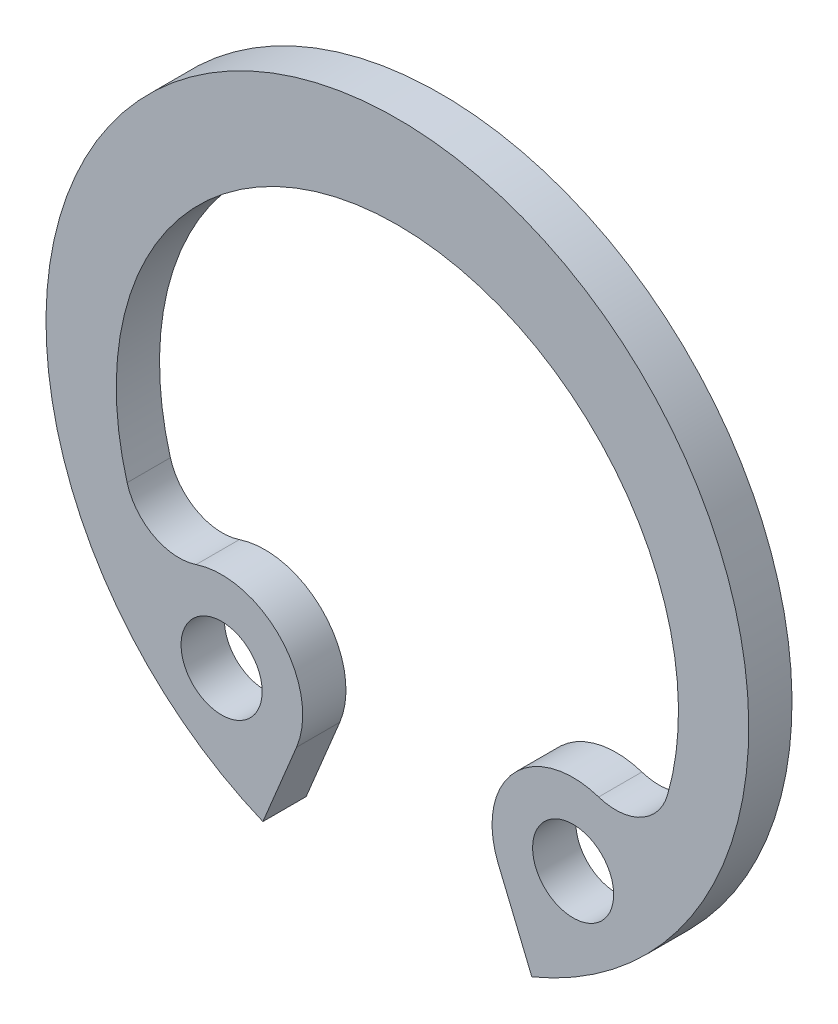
ISO-10303-21;
HEADER;
FILE_DESCRIPTION(('STEP AP214'),'2;1');
FILE_NAME('part.step','',(''),(''),'','','');
FILE_SCHEMA(('AUTOMOTIVE_DESIGN { 1 0 10303 214 1 1 1 1 }'));
ENDSEC;
DATA;
#1=APPLICATION_CONTEXT('core data for automotive mechanical design processes');
#2=APPLICATION_PROTOCOL_DEFINITION('international standard','automotive_design',2000,#1);
#3=PRODUCT_CONTEXT('',#1,'mechanical');
#4=PRODUCT('Part','Part','',(#3));
#5=PRODUCT_RELATED_PRODUCT_CATEGORY('part','',(#4));
#6=PRODUCT_DEFINITION_FORMATION('','',#4);
#7=PRODUCT_DEFINITION_CONTEXT('part definition',#1,'design');
#8=PRODUCT_DEFINITION('design','',#6,#7);
#9=PRODUCT_DEFINITION_SHAPE('','',#8);
#10=(LENGTH_UNIT() NAMED_UNIT(*) SI_UNIT(.MILLI.,.METRE.));
#11=(NAMED_UNIT(*) PLANE_ANGLE_UNIT() SI_UNIT($,.RADIAN.));
#12=(NAMED_UNIT(*) SI_UNIT($,.STERADIAN.) SOLID_ANGLE_UNIT());
#13=UNCERTAINTY_MEASURE_WITH_UNIT(LENGTH_MEASURE(1.E-05),#10,'distance_accuracy_value','');
#14=(GEOMETRIC_REPRESENTATION_CONTEXT(3) GLOBAL_UNCERTAINTY_ASSIGNED_CONTEXT((#13)) GLOBAL_UNIT_ASSIGNED_CONTEXT((#10,
#11,#12)) REPRESENTATION_CONTEXT('',''));
#15=CARTESIAN_POINT('',(0.,0.,0.));
#16=DIRECTION('',(0.,0.,1.));
#17=DIRECTION('',(1.,0.,0.));
#18=AXIS2_PLACEMENT_3D('',#15,#16,#17);
#19=CARTESIAN_POINT('',(0.,0.,-0.8));
#20=DIRECTION('',(0.,0.,1.));
#21=DIRECTION('',(1.,0.,0.));
#22=AXIS2_PLACEMENT_3D('',#19,#20,#21);
#23=CYLINDRICAL_SURFACE('',#22,6.5);
#24=CARTESIAN_POINT('',(0.,0.,0.));
#25=DIRECTION('',(0.,0.,1.));
#26=DIRECTION('',(1.,0.,0.));
#27=AXIS2_PLACEMENT_3D('',#24,#25,#26);
#28=CIRCLE('',#27,6.5);
#29=CARTESIAN_POINT('',(2.48744231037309,-6.00521696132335,0.));
#30=VERTEX_POINT('',#29);
#31=CARTESIAN_POINT('',(-2.48744231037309,-6.00521696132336,0.));
#32=VERTEX_POINT('',#31);
#33=EDGE_CURVE('E130',#30,#32,#28,.T.);
#34=ORIENTED_EDGE('',*,*,#33,.F.);
#35=DIRECTION('',(0.,0.,1.));
#36=VECTOR('',#35,1.);
#37=CARTESIAN_POINT('',(2.48744231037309,-6.00521696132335,-0.8));
#38=LINE('',#37,#36);
#39=CARTESIAN_POINT('',(2.48744231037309,-6.00521696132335,-0.8));
#40=VERTEX_POINT('',#39);
#41=EDGE_CURVE('E11',#40,#30,#38,.T.);
#42=ORIENTED_EDGE('',*,*,#41,.F.);
#43=CARTESIAN_POINT('',(0.,0.,-0.8));
#44=DIRECTION('',(0.,0.,1.));
#45=DIRECTION('',(1.,0.,0.));
#46=AXIS2_PLACEMENT_3D('',#43,#44,#45);
#47=CIRCLE('',#46,6.5);
#48=CARTESIAN_POINT('',(-2.48744231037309,-6.00521696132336,-0.8));
#49=VERTEX_POINT('',#48);
#50=EDGE_CURVE('E151',#40,#49,#47,.T.);
#51=ORIENTED_EDGE('',*,*,#50,.T.);
#52=DIRECTION('',(0.,0.,1.));
#53=VECTOR('',#52,1.);
#54=CARTESIAN_POINT('',(-2.48744231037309,-6.00521696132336,-0.8));
#55=LINE('',#54,#53);
#56=EDGE_CURVE('E36',#49,#32,#55,.T.);
#57=ORIENTED_EDGE('',*,*,#56,.T.);
#58=EDGE_LOOP('',(#34,#42,#51,#57));
#59=FACE_BOUND('',#58,.T.);
#60=ADVANCED_FACE('F33',(#59),#23,.T.);
#61=CARTESIAN_POINT('',(1.86536094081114,-4.50337968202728,-0.8));
#62=DIRECTION('',(-0.923879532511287,-0.38268343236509,0.));
#63=DIRECTION('',(0.38268343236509,-0.923879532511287,0.));
#64=AXIS2_PLACEMENT_3D('',#61,#62,#63);
#65=PLANE('',#64);
#66=DIRECTION('',(0.38268343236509,-0.923879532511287,0.));
#67=VECTOR('',#66,1.);
#68=CARTESIAN_POINT('',(1.86536094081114,-4.50337968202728,0.));
#69=LINE('',#68,#67);
#70=CARTESIAN_POINT('',(1.86536094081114,-4.50337968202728,0.));
#71=VERTEX_POINT('',#70);
#72=EDGE_CURVE('E149',#71,#30,#69,.T.);
#73=ORIENTED_EDGE('',*,*,#72,.F.);
#74=DIRECTION('',(0.,0.,1.));
#75=VECTOR('',#74,1.);
#76=CARTESIAN_POINT('',(1.86536094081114,-4.50337968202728,-0.8));
#77=LINE('',#76,#75);
#78=CARTESIAN_POINT('',(1.86536094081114,-4.50337968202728,-0.8));
#79=VERTEX_POINT('',#78);
#80=EDGE_CURVE('E42',#79,#71,#77,.T.);
#81=ORIENTED_EDGE('',*,*,#80,.F.);
#82=DIRECTION('',(0.38268343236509,-0.923879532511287,0.));
#83=VECTOR('',#82,1.);
#84=CARTESIAN_POINT('',(1.86536094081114,-4.50337968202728,-0.8));
#85=LINE('',#84,#83);
#86=EDGE_CURVE('E120',#79,#40,#85,.T.);
#87=ORIENTED_EDGE('',*,*,#86,.T.);
#88=ORIENTED_EDGE('',*,*,#41,.T.);
#89=EDGE_LOOP('',(#73,#81,#87,#88));
#90=FACE_BOUND('',#89,.T.);
#91=ADVANCED_FACE('F163',(#90),#65,.T.);
#92=CARTESIAN_POINT('',(3.25118023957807,-3.92935453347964,-0.8));
#93=DIRECTION('',(0.,0.,1.));
#94=DIRECTION('',(1.,0.,0.));
#95=AXIS2_PLACEMENT_3D('',#92,#93,#94);
#96=CYLINDRICAL_SURFACE('',#95,1.5);
#97=CARTESIAN_POINT('',(3.25118023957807,-3.92935453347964,0.));
#98=DIRECTION('',(0.,0.,1.));
#99=DIRECTION('',(-1.,0.,0.));
#100=AXIS2_PLACEMENT_3D('',#97,#98,#99);
#101=CIRCLE('',#100,1.5);
#102=CARTESIAN_POINT('',(3.72308859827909,-2.5055207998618,0.));
#103=VERTEX_POINT('',#102);
#104=EDGE_CURVE('E107',#103,#71,#101,.T.);
#105=ORIENTED_EDGE('',*,*,#104,.F.);
#106=DIRECTION('',(0.,0.,1.));
#107=VECTOR('',#106,1.);
#108=CARTESIAN_POINT('',(3.72308859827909,-2.5055207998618,-0.8));
#109=LINE('',#108,#107);
#110=CARTESIAN_POINT('',(3.72308859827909,-2.5055207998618,-0.8));
#111=VERTEX_POINT('',#110);
#112=EDGE_CURVE('E102',#111,#103,#109,.T.);
#113=ORIENTED_EDGE('',*,*,#112,.F.);
#114=CARTESIAN_POINT('',(3.25118023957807,-3.92935453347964,-0.8));
#115=DIRECTION('',(0.,0.,1.));
#116=DIRECTION('',(-1.,0.,0.));
#117=AXIS2_PLACEMENT_3D('',#114,#115,#116);
#118=CIRCLE('',#117,1.5);
#119=EDGE_CURVE('E105',#111,#79,#118,.T.);
#120=ORIENTED_EDGE('',*,*,#119,.T.);
#121=ORIENTED_EDGE('',*,*,#80,.T.);
#122=EDGE_LOOP('',(#105,#113,#120,#121));
#123=FACE_BOUND('',#122,.T.);
#124=ADVANCED_FACE('F104',(#123),#96,.T.);
#125=CARTESIAN_POINT('',(4.03769417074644,-1.55629831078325,-0.8));
#126=DIRECTION('',(0.,0.,1.));
#127=DIRECTION('',(1.,0.,0.));
#128=AXIS2_PLACEMENT_3D('',#125,#126,#127);
#129=CYLINDRICAL_SURFACE('',#128,1.);
#130=CARTESIAN_POINT('',(4.03769417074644,-1.55629831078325,0.));
#131=DIRECTION('',(0.,0.,-1.));
#132=DIRECTION('',(-1.,0.,0.));
#133=AXIS2_PLACEMENT_3D('',#130,#131,#132);
#134=CIRCLE('',#133,1.);
#135=CARTESIAN_POINT('',(4.99904992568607,-1.83160743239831,0.));
#136=VERTEX_POINT('',#135);
#137=EDGE_CURVE('E146',#136,#103,#134,.T.);
#138=ORIENTED_EDGE('',*,*,#137,.F.);
#139=DIRECTION('',(0.,0.,1.));
#140=VECTOR('',#139,1.);
#141=CARTESIAN_POINT('',(4.99904992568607,-1.83160743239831,-0.8));
#142=LINE('',#141,#140);
#143=CARTESIAN_POINT('',(4.99904992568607,-1.83160743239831,-0.8));
#144=VERTEX_POINT('',#143);
#145=EDGE_CURVE('E112',#144,#136,#142,.T.);
#146=ORIENTED_EDGE('',*,*,#145,.F.);
#147=CARTESIAN_POINT('',(4.03769417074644,-1.55629831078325,-0.8));
#148=DIRECTION('',(0.,0.,-1.));
#149=DIRECTION('',(-1.,0.,0.));
#150=AXIS2_PLACEMENT_3D('',#147,#148,#149);
#151=CIRCLE('',#150,1.);
#152=EDGE_CURVE('E118',#144,#111,#151,.T.);
#153=ORIENTED_EDGE('',*,*,#152,.T.);
#154=ORIENTED_EDGE('',*,*,#112,.T.);
#155=EDGE_LOOP('',(#138,#146,#153,#154));
#156=FACE_BOUND('',#155,.T.);
#157=ADVANCED_FACE('F122',(#156),#129,.F.);
#158=CARTESIAN_POINT('',(0.,-0.4,-0.8));
#159=DIRECTION('',(0.,0.,1.));
#160=DIRECTION('',(1.,0.,0.));
#161=AXIS2_PLACEMENT_3D('',#158,#159,#160);
#162=CYLINDRICAL_SURFACE('',#161,5.2);
#163=CARTESIAN_POINT('',(0.,-0.4,0.));
#164=DIRECTION('',(0.,0.,-1.));
#165=DIRECTION('',(1.,0.,0.));
#166=AXIS2_PLACEMENT_3D('',#163,#164,#165);
#167=CIRCLE('',#166,5.2);
#168=CARTESIAN_POINT('',(-4.99904992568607,-1.83160743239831,0.));
#169=VERTEX_POINT('',#168);
#170=EDGE_CURVE('E143',#169,#136,#167,.T.);
#171=ORIENTED_EDGE('',*,*,#170,.F.);
#172=DIRECTION('',(0.,0.,1.));
#173=VECTOR('',#172,1.);
#174=CARTESIAN_POINT('',(-4.99904992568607,-1.83160743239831,-0.8));
#175=LINE('',#174,#173);
#176=CARTESIAN_POINT('',(-4.99904992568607,-1.83160743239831,-0.8));
#177=VERTEX_POINT('',#176);
#178=EDGE_CURVE('E155',#177,#169,#175,.T.);
#179=ORIENTED_EDGE('',*,*,#178,.F.);
#180=CARTESIAN_POINT('',(0.,-0.4,-0.8));
#181=DIRECTION('',(0.,0.,-1.));
#182=DIRECTION('',(1.,0.,0.));
#183=AXIS2_PLACEMENT_3D('',#180,#181,#182);
#184=CIRCLE('',#183,5.2);
#185=EDGE_CURVE('E123',#177,#144,#184,.T.);
#186=ORIENTED_EDGE('',*,*,#185,.T.);
#187=ORIENTED_EDGE('',*,*,#145,.T.);
#188=EDGE_LOOP('',(#171,#179,#186,#187));
#189=FACE_BOUND('',#188,.T.);
#190=ADVANCED_FACE('F176',(#189),#162,.F.);
#191=CARTESIAN_POINT('',(-4.03769417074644,-1.55629831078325,-0.8));
#192=DIRECTION('',(0.,0.,1.));
#193=DIRECTION('',(1.,0.,0.));
#194=AXIS2_PLACEMENT_3D('',#191,#192,#193);
#195=CYLINDRICAL_SURFACE('',#194,1.);
#196=CARTESIAN_POINT('',(-4.03769417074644,-1.55629831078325,0.));
#197=DIRECTION('',(0.,0.,-1.));
#198=DIRECTION('',(1.,0.,0.));
#199=AXIS2_PLACEMENT_3D('',#196,#197,#198);
#200=CIRCLE('',#199,1.);
#201=CARTESIAN_POINT('',(-3.7230885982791,-2.50552079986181,0.));
#202=VERTEX_POINT('',#201);
#203=EDGE_CURVE('E140',#202,#169,#200,.T.);
#204=ORIENTED_EDGE('',*,*,#203,.F.);
#205=DIRECTION('',(0.,0.,1.));
#206=VECTOR('',#205,1.);
#207=CARTESIAN_POINT('',(-3.7230885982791,-2.50552079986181,-0.8));
#208=LINE('',#207,#206);
#209=CARTESIAN_POINT('',(-3.7230885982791,-2.50552079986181,-0.8));
#210=VERTEX_POINT('',#209);
#211=EDGE_CURVE('E157',#210,#202,#208,.T.);
#212=ORIENTED_EDGE('',*,*,#211,.F.);
#213=CARTESIAN_POINT('',(-4.03769417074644,-1.55629831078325,-0.8));
#214=DIRECTION('',(0.,0.,-1.));
#215=DIRECTION('',(1.,0.,0.));
#216=AXIS2_PLACEMENT_3D('',#213,#214,#215);
#217=CIRCLE('',#216,1.);
#218=EDGE_CURVE('E125',#210,#177,#217,.T.);
#219=ORIENTED_EDGE('',*,*,#218,.T.);
#220=ORIENTED_EDGE('',*,*,#178,.T.);
#221=EDGE_LOOP('',(#204,#212,#219,#220));
#222=FACE_BOUND('',#221,.T.);
#223=ADVANCED_FACE('F179',(#222),#195,.F.);
#224=CARTESIAN_POINT('',(-3.25118023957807,-3.92935453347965,-0.8));
#225=DIRECTION('',(0.,0.,1.));
#226=DIRECTION('',(1.,0.,0.));
#227=AXIS2_PLACEMENT_3D('',#224,#225,#226);
#228=CYLINDRICAL_SURFACE('',#227,1.5);
#229=CARTESIAN_POINT('',(-3.25118023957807,-3.92935453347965,0.));
#230=DIRECTION('',(0.,0.,1.));
#231=DIRECTION('',(1.,0.,0.));
#232=AXIS2_PLACEMENT_3D('',#229,#230,#231);
#233=CIRCLE('',#232,1.5);
#234=CARTESIAN_POINT('',(-1.86536094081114,-4.50337968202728,0.));
#235=VERTEX_POINT('',#234);
#236=EDGE_CURVE('E137',#235,#202,#233,.T.);
#237=ORIENTED_EDGE('',*,*,#236,.F.);
#238=DIRECTION('',(0.,0.,1.));
#239=VECTOR('',#238,1.);
#240=CARTESIAN_POINT('',(-1.86536094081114,-4.50337968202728,-0.8));
#241=LINE('',#240,#239);
#242=CARTESIAN_POINT('',(-1.86536094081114,-4.50337968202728,-0.8));
#243=VERTEX_POINT('',#242);
#244=EDGE_CURVE('E158',#243,#235,#241,.T.);
#245=ORIENTED_EDGE('',*,*,#244,.F.);
#246=CARTESIAN_POINT('',(-3.25118023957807,-3.92935453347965,-0.8));
#247=DIRECTION('',(0.,0.,1.));
#248=DIRECTION('',(1.,0.,0.));
#249=AXIS2_PLACEMENT_3D('',#246,#247,#248);
#250=CIRCLE('',#249,1.5);
#251=EDGE_CURVE('E225',#243,#210,#250,.T.);
#252=ORIENTED_EDGE('',*,*,#251,.T.);
#253=ORIENTED_EDGE('',*,*,#211,.T.);
#254=EDGE_LOOP('',(#237,#245,#252,#253));
#255=FACE_BOUND('',#254,.T.);
#256=ADVANCED_FACE('F183',(#255),#228,.T.);
#257=CARTESIAN_POINT('',(-1.86536094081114,-4.50337968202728,-0.8));
#258=DIRECTION('',(0.923879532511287,-0.38268343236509,0.));
#259=DIRECTION('',(0.38268343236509,0.923879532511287,0.));
#260=AXIS2_PLACEMENT_3D('',#257,#258,#259);
#261=PLANE('',#260);
#262=DIRECTION('',(0.38268343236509,0.923879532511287,0.));
#263=VECTOR('',#262,1.);
#264=CARTESIAN_POINT('',(-1.86536094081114,-4.50337968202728,0.));
#265=LINE('',#264,#263);
#266=EDGE_CURVE('E133',#32,#235,#265,.T.);
#267=ORIENTED_EDGE('',*,*,#266,.F.);
#268=ORIENTED_EDGE('',*,*,#56,.F.);
#269=DIRECTION('',(0.38268343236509,0.923879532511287,0.));
#270=VECTOR('',#269,1.);
#271=CARTESIAN_POINT('',(-1.86536094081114,-4.50337968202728,-0.8));
#272=LINE('',#271,#270);
#273=EDGE_CURVE('E223',#49,#243,#272,.T.);
#274=ORIENTED_EDGE('',*,*,#273,.T.);
#275=ORIENTED_EDGE('',*,*,#244,.T.);
#276=EDGE_LOOP('',(#267,#268,#274,#275));
#277=FACE_BOUND('',#276,.T.);
#278=ADVANCED_FACE('F160',(#277),#261,.T.);
#279=CARTESIAN_POINT('',(0.,0.,-0.8));
#280=DIRECTION('',(0.,0.,1.));
#281=DIRECTION('',(1.,0.,0.));
#282=AXIS2_PLACEMENT_3D('',#279,#280,#281);
#283=PLANE('',#282);
#284=CARTESIAN_POINT('',(-3.25118023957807,-3.92935453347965,-0.8));
#285=DIRECTION('',(0.,0.,1.));
#286=DIRECTION('',(1.,0.,0.));
#287=AXIS2_PLACEMENT_3D('',#284,#285,#286);
#288=CIRCLE('',#287,0.75);
#289=CARTESIAN_POINT('',(-2.50118023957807,-3.92935453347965,-0.8));
#290=VERTEX_POINT('',#289);
#291=EDGE_CURVE('E210',#290,#290,#288,.T.);
#292=ORIENTED_EDGE('',*,*,#291,.T.);
#293=EDGE_LOOP('',(#292));
#294=FACE_BOUND('',#293,.T.);
#295=CARTESIAN_POINT('',(3.25118023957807,-3.92935453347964,-0.8));
#296=DIRECTION('',(0.,0.,1.));
#297=DIRECTION('',(-1.,0.,0.));
#298=AXIS2_PLACEMENT_3D('',#295,#296,#297);
#299=CIRCLE('',#298,0.75);
#300=CARTESIAN_POINT('',(2.50118023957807,-3.92935453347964,-0.8));
#301=VERTEX_POINT('',#300);
#302=EDGE_CURVE('E134',#301,#301,#299,.T.);
#303=ORIENTED_EDGE('',*,*,#302,.T.);
#304=EDGE_LOOP('',(#303));
#305=FACE_BOUND('',#304,.T.);
#306=ORIENTED_EDGE('',*,*,#50,.F.);
#307=ORIENTED_EDGE('',*,*,#86,.F.);
#308=ORIENTED_EDGE('',*,*,#119,.F.);
#309=ORIENTED_EDGE('',*,*,#152,.F.);
#310=ORIENTED_EDGE('',*,*,#185,.F.);
#311=ORIENTED_EDGE('',*,*,#218,.F.);
#312=ORIENTED_EDGE('',*,*,#251,.F.);
#313=ORIENTED_EDGE('',*,*,#273,.F.);
#314=EDGE_LOOP('',(#306,#307,#308,#309,#310,#311,#312,#313));
#315=FACE_BOUND('',#314,.T.);
#316=ADVANCED_FACE('F116',(#294,#305,#315),#283,.F.);
#317=CARTESIAN_POINT('',(0.,0.,0.));
#318=DIRECTION('',(0.,0.,1.));
#319=DIRECTION('',(1.,0.,0.));
#320=AXIS2_PLACEMENT_3D('',#317,#318,#319);
#321=PLANE('',#320);
#322=CARTESIAN_POINT('',(-3.25118023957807,-3.92935453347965,0.));
#323=DIRECTION('',(0.,0.,1.));
#324=DIRECTION('',(1.,0.,0.));
#325=AXIS2_PLACEMENT_3D('',#322,#323,#324);
#326=CIRCLE('',#325,0.75);
#327=CARTESIAN_POINT('',(-2.50118023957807,-3.92935453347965,0.));
#328=VERTEX_POINT('',#327);
#329=EDGE_CURVE('E213',#328,#328,#326,.T.);
#330=ORIENTED_EDGE('',*,*,#329,.F.);
#331=EDGE_LOOP('',(#330));
#332=FACE_BOUND('',#331,.T.);
#333=CARTESIAN_POINT('',(3.25118023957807,-3.92935453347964,0.));
#334=DIRECTION('',(0.,0.,1.));
#335=DIRECTION('',(-1.,0.,0.));
#336=AXIS2_PLACEMENT_3D('',#333,#334,#335);
#337=CIRCLE('',#336,0.75);
#338=CARTESIAN_POINT('',(2.50118023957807,-3.92935453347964,0.));
#339=VERTEX_POINT('',#338);
#340=EDGE_CURVE('E215',#339,#339,#337,.T.);
#341=ORIENTED_EDGE('',*,*,#340,.F.);
#342=EDGE_LOOP('',(#341));
#343=FACE_BOUND('',#342,.T.);
#344=ORIENTED_EDGE('',*,*,#33,.T.);
#345=ORIENTED_EDGE('',*,*,#266,.T.);
#346=ORIENTED_EDGE('',*,*,#236,.T.);
#347=ORIENTED_EDGE('',*,*,#203,.T.);
#348=ORIENTED_EDGE('',*,*,#170,.T.);
#349=ORIENTED_EDGE('',*,*,#137,.T.);
#350=ORIENTED_EDGE('',*,*,#104,.T.);
#351=ORIENTED_EDGE('',*,*,#72,.T.);
#352=EDGE_LOOP('',(#344,#345,#346,#347,#348,#349,#350,#351));
#353=FACE_BOUND('',#352,.T.);
#354=ADVANCED_FACE('F162',(#332,#343,#353),#321,.T.);
#355=CARTESIAN_POINT('',(3.25118023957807,-3.92935453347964,-0.8));
#356=DIRECTION('',(0.,0.,1.));
#357=DIRECTION('',(1.,0.,0.));
#358=AXIS2_PLACEMENT_3D('',#355,#356,#357);
#359=CYLINDRICAL_SURFACE('',#358,0.75);
#360=ORIENTED_EDGE('',*,*,#302,.F.);
#361=EDGE_LOOP('',(#360));
#362=FACE_BOUND('',#361,.T.);
#363=ORIENTED_EDGE('',*,*,#340,.T.);
#364=EDGE_LOOP('',(#363));
#365=FACE_BOUND('',#364,.T.);
#366=ADVANCED_FACE('F195',(#362,#365),#359,.F.);
#367=CARTESIAN_POINT('',(-3.25118023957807,-3.92935453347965,-0.8));
#368=DIRECTION('',(0.,0.,1.));
#369=DIRECTION('',(1.,0.,0.));
#370=AXIS2_PLACEMENT_3D('',#367,#368,#369);
#371=CYLINDRICAL_SURFACE('',#370,0.75);
#372=ORIENTED_EDGE('',*,*,#291,.F.);
#373=EDGE_LOOP('',(#372));
#374=FACE_BOUND('',#373,.T.);
#375=ORIENTED_EDGE('',*,*,#329,.T.);
#376=EDGE_LOOP('',(#375));
#377=FACE_BOUND('',#376,.T.);
#378=ADVANCED_FACE('F202',(#374,#377),#371,.F.);
#379=CLOSED_SHELL('',(#60,#91,#124,#157,#190,#223,#256,#278,#316,#354,#366,#378));
#380=MANIFOLD_SOLID_BREP('B2',#379);
#381=ADVANCED_BREP_SHAPE_REPRESENTATION('',(#18,#380),#14);
#382=SHAPE_DEFINITION_REPRESENTATION(#9,#381);
ENDSEC;
END-ISO-10303-21;
